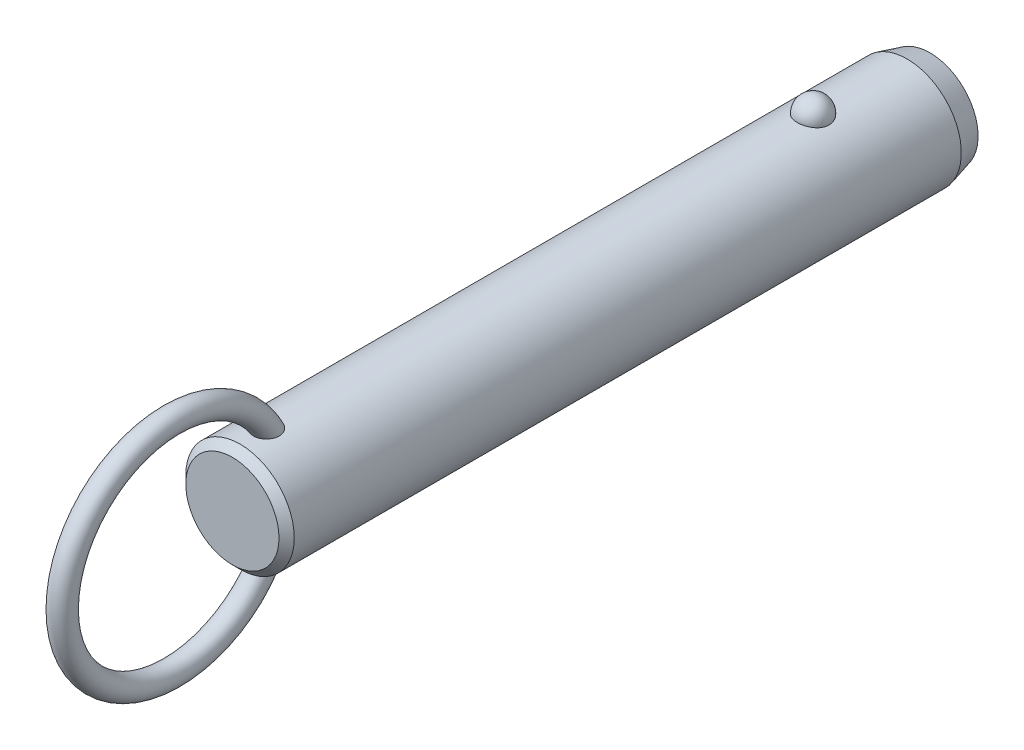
ISO-10303-21;
HEADER;
FILE_DESCRIPTION(('STEP AP214'),'2;1');
FILE_NAME('part.step','',(''),(''),'','','');
FILE_SCHEMA(('AUTOMOTIVE_DESIGN { 1 0 10303 214 1 1 1 1 }'));
ENDSEC;
DATA;
#1=APPLICATION_CONTEXT('core data for automotive mechanical design processes');
#2=APPLICATION_PROTOCOL_DEFINITION('international standard','automotive_design',2000,#1);
#3=PRODUCT_CONTEXT('',#1,'mechanical');
#4=PRODUCT('Part','Part','',(#3));
#5=PRODUCT_RELATED_PRODUCT_CATEGORY('part','',(#4));
#6=PRODUCT_DEFINITION_FORMATION('','',#4);
#7=PRODUCT_DEFINITION_CONTEXT('part definition',#1,'design');
#8=PRODUCT_DEFINITION('design','',#6,#7);
#9=PRODUCT_DEFINITION_SHAPE('','',#8);
#10=(LENGTH_UNIT() NAMED_UNIT(*) SI_UNIT(.MILLI.,.METRE.));
#11=(NAMED_UNIT(*) PLANE_ANGLE_UNIT() SI_UNIT($,.RADIAN.));
#12=(NAMED_UNIT(*) SI_UNIT($,.STERADIAN.) SOLID_ANGLE_UNIT());
#13=UNCERTAINTY_MEASURE_WITH_UNIT(LENGTH_MEASURE(1.E-05),#10,'distance_accuracy_value','');
#14=(GEOMETRIC_REPRESENTATION_CONTEXT(3) GLOBAL_UNCERTAINTY_ASSIGNED_CONTEXT((#13)) GLOBAL_UNIT_ASSIGNED_CONTEXT((#10,
#11,#12)) REPRESENTATION_CONTEXT('',''));
#15=CARTESIAN_POINT('',(0.,0.,0.));
#16=DIRECTION('',(0.,0.,1.));
#17=DIRECTION('',(1.,0.,0.));
#18=AXIS2_PLACEMENT_3D('',#15,#16,#17);
#19=CARTESIAN_POINT('',(0.,0.,66.));
#20=DIRECTION('',(0.,0.,-1.));
#21=DIRECTION('',(-1.,0.,0.));
#22=AXIS2_PLACEMENT_3D('',#19,#20,#21);
#23=CYLINDRICAL_SURFACE('',#22,7.1);
#24=CARTESIAN_POINT('',(2.0769088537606,6.78943661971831,-2.1));
#25=CARTESIAN_POINT('',(2.07690739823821,6.78943796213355,-1.98268154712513));
#26=CARTESIAN_POINT('',(2.06738130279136,6.79237331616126,-1.86534506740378));
#27=CARTESIAN_POINT('',(2.0295040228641,6.8037853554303,-1.63400788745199));
#28=CARTESIAN_POINT('',(2.00114757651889,6.81226358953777,-1.52000812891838));
#29=CARTESIAN_POINT('',(1.92632025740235,6.83379798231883,-1.29863433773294));
#30=CARTESIAN_POINT('',(1.87985726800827,6.84685214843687,-1.19125744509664));
#31=CARTESIAN_POINT('',(1.76995205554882,6.87608091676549,-0.98604657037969));
#32=CARTESIAN_POINT('',(1.70650980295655,6.8922555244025,-0.88821260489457));
#33=CARTESIAN_POINT('',(1.5638119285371,6.92602930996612,-0.704242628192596));
#34=CARTESIAN_POINT('',(1.4844714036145,6.94363582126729,-0.618173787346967));
#35=CARTESIAN_POINT('',(1.31221746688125,6.97823658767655,-0.460740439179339));
#36=CARTESIAN_POINT('',(1.21930409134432,6.99523084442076,-0.389375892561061));
#37=CARTESIAN_POINT('',(1.02268781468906,7.02666176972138,-0.263547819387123));
#38=CARTESIAN_POINT('',(0.91902009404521,7.04110638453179,-0.209031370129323));
#39=CARTESIAN_POINT('',(0.703548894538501,7.06588726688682,-0.118163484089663));
#40=CARTESIAN_POINT('',(0.591746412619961,7.07622403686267,-0.0818098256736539));
#41=CARTESIAN_POINT('',(0.365557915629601,7.09147068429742,-0.0288711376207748));
#42=CARTESIAN_POINT('',(0.251267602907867,7.09648447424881,-0.0119070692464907));
#43=CARTESIAN_POINT('',(0.0213499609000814,7.10089837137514,0.00304925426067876));
#44=CARTESIAN_POINT('',(-0.0942772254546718,7.10029907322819,0.00104351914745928));
#45=CARTESIAN_POINT('',(-0.321651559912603,7.09360829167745,-0.0216931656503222));
#46=CARTESIAN_POINT('',(-0.433431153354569,7.08760388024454,-0.0421272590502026));
#47=CARTESIAN_POINT('',(-0.651862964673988,7.07086131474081,-0.100729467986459));
#48=CARTESIAN_POINT('',(-0.758515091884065,7.06012307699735,-0.138897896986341));
#49=CARTESIAN_POINT('',(-0.964449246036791,7.03496097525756,-0.232213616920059));
#50=CARTESIAN_POINT('',(-1.06368095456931,7.02051445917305,-0.287465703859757));
#51=CARTESIAN_POINT('',(-1.25145353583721,6.98948740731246,-0.413383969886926));
#52=CARTESIAN_POINT('',(-1.33999321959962,6.97290663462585,-0.48405186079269));
#53=CARTESIAN_POINT('',(-1.50591604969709,6.93898770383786,-0.640594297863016));
#54=CARTESIAN_POINT('',(-1.58302488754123,6.92164094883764,-0.726757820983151));
#55=CARTESIAN_POINT('',(-1.72189320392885,6.8884103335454,-0.91092752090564));
#56=CARTESIAN_POINT('',(-1.78365144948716,6.87252659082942,-1.008934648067));
#57=CARTESIAN_POINT('',(-1.89101272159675,6.84377189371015,-1.21549497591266));
#58=CARTESIAN_POINT('',(-1.93639553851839,6.83094274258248,-1.32416860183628));
#59=CARTESIAN_POINT('',(-2.00874275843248,6.81002070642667,-1.54791500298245));
#60=CARTESIAN_POINT('',(-2.03570774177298,6.80192767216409,-1.66298757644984));
#61=CARTESIAN_POINT('',(-2.07047276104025,6.7914266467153,-1.89571453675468));
#62=CARTESIAN_POINT('',(-2.07835878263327,6.78899315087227,-2.01335491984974));
#63=CARTESIAN_POINT('',(-2.07502083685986,6.79001409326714,-2.24833570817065));
#64=CARTESIAN_POINT('',(-2.06379746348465,6.7934683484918,-2.36567612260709));
#65=CARTESIAN_POINT('',(-2.02263913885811,6.80583442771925,-2.59603194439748));
#66=CARTESIAN_POINT('',(-1.99281127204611,6.81471501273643,-2.70906820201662));
#67=CARTESIAN_POINT('',(-1.91526639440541,6.83691232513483,-2.92836575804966));
#68=CARTESIAN_POINT('',(-1.8675486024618,6.85022924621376,-3.03462676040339));
#69=CARTESIAN_POINT('',(-1.75504492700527,6.87991336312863,-3.23806487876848));
#70=CARTESIAN_POINT('',(-1.69015924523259,6.89629822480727,-3.33518422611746));
#71=CARTESIAN_POINT('',(-1.54505404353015,6.93024852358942,-3.51697105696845));
#72=CARTESIAN_POINT('',(-1.46483385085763,6.94781401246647,-3.60163799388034));
#73=CARTESIAN_POINT('',(-1.29071406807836,6.98225977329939,-3.75654119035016));
#74=CARTESIAN_POINT('',(-1.19675650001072,6.99913673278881,-3.82671308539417));
#75=CARTESIAN_POINT('',(-0.997940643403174,7.03023618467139,-3.9501837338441));
#76=CARTESIAN_POINT('',(-0.89308318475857,7.04445887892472,-4.00348377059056));
#77=CARTESIAN_POINT('',(-0.676902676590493,7.06848365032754,-4.09107242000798));
#78=CARTESIAN_POINT('',(-0.565686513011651,7.0783430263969,-4.12560889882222));
#79=CARTESIAN_POINT('',(-0.338739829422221,7.09282534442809,-4.17575450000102));
#80=CARTESIAN_POINT('',(-0.223009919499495,7.09744899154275,-4.19136617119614));
#81=CARTESIAN_POINT('',(0.00707628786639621,7.10090930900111,-4.20307965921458));
#82=CARTESIAN_POINT('',(0.121410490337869,7.09986531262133,-4.19958377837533));
#83=CARTESIAN_POINT('',(0.347815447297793,7.092380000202,-4.17411564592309));
#84=CARTESIAN_POINT('',(0.459886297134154,7.08593891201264,-4.15214417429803));
#85=CARTESIAN_POINT('',(0.678084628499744,7.06838983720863,-4.09049562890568));
#86=CARTESIAN_POINT('',(0.784237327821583,7.05730369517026,-4.05090137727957));
#87=CARTESIAN_POINT('',(0.988305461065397,7.03163139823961,-3.95511447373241));
#88=CARTESIAN_POINT('',(1.08622031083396,7.01704499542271,-3.89892064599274));
#89=CARTESIAN_POINT('',(1.27284490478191,6.98562668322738,-3.77035541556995));
#90=CARTESIAN_POINT('',(1.36137372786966,6.96876135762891,-3.69772964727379));
#91=CARTESIAN_POINT('',(1.52509486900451,6.93477412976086,-3.53878279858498));
#92=CARTESIAN_POINT('',(1.60028496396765,6.91765218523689,-3.45245943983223));
#93=CARTESIAN_POINT('',(1.73681688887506,6.88465753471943,-3.26658774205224));
#94=CARTESIAN_POINT('',(1.79785966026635,6.86881574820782,-3.16681408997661));
#95=CARTESIAN_POINT('',(1.90265327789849,6.84053157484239,-2.95814408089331));
#96=CARTESIAN_POINT('',(1.94640861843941,6.82808830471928,-2.84925010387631));
#97=CARTESIAN_POINT('',(2.01274378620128,6.80881460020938,-2.63454318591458));
#98=CARTESIAN_POINT('',(2.03676193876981,6.80160856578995,-2.52920574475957));
#99=CARTESIAN_POINT('',(2.06884490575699,6.79191902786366,-2.3159172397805));
#100=CARTESIAN_POINT('',(2.07691019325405,6.78943538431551,-2.20796625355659));
#101=CARTESIAN_POINT('',(2.0769088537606,6.78943661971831,-2.1));
#102=B_SPLINE_CURVE_WITH_KNOTS('',3,(#24,#25,#26,#27,#28,#29,#30,#31,#32,#33,#34,#35,#36,#37,
#38,#39,#40,#41,#42,#43,#44,#45,#46,#47,#48,#49,#50,#51,#52,#53,#54,#55,#56,#57,#58,#59,#60,#61,
#62,#63,#64,#65,#66,#67,#68,#69,#70,#71,#72,#73,#74,#75,#76,#77,#78,#79,#80,#81,#82,#83,#84,#85,
#86,#87,#88,#89,#90,#91,#92,#93,#94,#95,#96,#97,#98,#99,#100,#101),.UNSPECIFIED.,.T.,.F.,(4,2,2,
2,2,2,2,2,2,2,2,2,2,2,2,2,2,2,2,2,2,2,2,2,2,2,2,2,2,2,2,2,2,2,2,2,2,2,4),(0.,0.351568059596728,
0.703234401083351,1.05474780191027,1.40626181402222,1.75970563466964,2.11314851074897,
2.4654696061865,2.81774759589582,3.16301449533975,3.50824481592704,3.84801136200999,
4.18778391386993,4.52968352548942,4.87162112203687,5.22076181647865,5.56993054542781,
5.92363364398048,6.27732559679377,6.62942052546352,6.98150450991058,7.33158042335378,
7.68167162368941,8.03384443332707,8.38603269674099,8.73975272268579,9.09344583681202,
9.44234545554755,9.79119807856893,10.1327344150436,10.4742563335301,10.8141898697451,
11.1541474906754,11.4997793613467,11.8454687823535,12.1979079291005,12.5502553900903,
12.8738073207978,13.1973496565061),.UNSPECIFIED.);
#103=CARTESIAN_POINT('',(2.0769088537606,6.78943661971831,-2.1));
#104=VERTEX_POINT('',#103);
#105=EDGE_CURVE('E41',#104,#104,#102,.T.);
#106=ORIENTED_EDGE('',*,*,#105,.T.);
#107=EDGE_LOOP('',(#106));
#108=FACE_BOUND('',#107,.T.);
#109=CARTESIAN_POINT('',(0.,0.,72.92));
#110=DIRECTION('',(0.,0.,1.));
#111=DIRECTION('',(1.,0.,0.));
#112=AXIS2_PLACEMENT_3D('',#109,#110,#111);
#113=CIRCLE('',#112,7.1);
#114=CARTESIAN_POINT('',(7.1,0.,72.92));
#115=VERTEX_POINT('',#114);
#116=EDGE_CURVE('E10',#115,#115,#113,.F.);
#117=ORIENTED_EDGE('',*,*,#116,.T.);
#118=EDGE_LOOP('',(#117));
#119=FACE_BOUND('',#118,.T.);
#120=CARTESIAN_POINT('',(-0.429539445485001,-7.08699541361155,67.7429212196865));
#121=CARTESIAN_POINT('',(-0.508331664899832,-7.08221999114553,67.7668764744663));
#122=CARTESIAN_POINT('',(-0.58503984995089,-7.07624016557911,67.7974570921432));
#123=CARTESIAN_POINT('',(-0.732082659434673,-7.06254296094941,67.8710242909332));
#124=CARTESIAN_POINT('',(-0.802417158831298,-7.05482554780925,67.9140111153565));
#125=CARTESIAN_POINT('',(-0.93472277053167,-7.03851844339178,68.0111135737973));
#126=CARTESIAN_POINT('',(-0.99670020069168,-7.02992941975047,68.0652207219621));
#127=CARTESIAN_POINT('',(-1.11079942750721,-7.01280697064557,68.1829676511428));
#128=CARTESIAN_POINT('',(-1.16292136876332,-7.00427354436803,68.2466072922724));
#129=CARTESIAN_POINT('',(-1.25705660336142,-6.98799959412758,68.3826870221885));
#130=CARTESIAN_POINT('',(-1.29888032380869,-6.98027525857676,68.4552598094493));
#131=CARTESIAN_POINT('',(-1.37069920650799,-6.96652886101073,68.6061686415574));
#132=CARTESIAN_POINT('',(-1.40069157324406,-6.96050720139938,68.6845060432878));
#133=CARTESIAN_POINT('',(-1.45043507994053,-6.95031881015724,68.8501903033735));
#134=CARTESIAN_POINT('',(-1.46937115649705,-6.94630231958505,68.9377897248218));
#135=CARTESIAN_POINT('',(-1.49424917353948,-6.94099239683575,69.1148714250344));
#136=CARTESIAN_POINT('',(-1.50018601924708,-6.93970003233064,69.2043544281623));
#137=CARTESIAN_POINT('',(-1.49978214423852,-6.93978815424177,69.3940607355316));
#138=CARTESIAN_POINT('',(-1.49187639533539,-6.94150934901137,69.494279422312));
#139=CARTESIAN_POINT('',(-1.46177925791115,-6.94790814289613,69.6924798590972));
#140=CARTESIAN_POINT('',(-1.43957541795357,-6.95258831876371,69.790459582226));
#141=CARTESIAN_POINT('',(-1.37783293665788,-6.96510647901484,69.9953629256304));
#142=CARTESIAN_POINT('',(-1.33634073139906,-6.97328848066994,70.1016801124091));
#143=CARTESIAN_POINT('',(-1.23686994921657,-6.99161706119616,70.3061777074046));
#144=CARTESIAN_POINT('',(-1.17889192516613,-7.00176357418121,70.4043583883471));
#145=CARTESIAN_POINT('',(-1.0587512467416,-7.02082898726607,70.5723743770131));
#146=CARTESIAN_POINT('',(-0.999247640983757,-7.02963746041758,70.6441230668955));
#147=CARTESIAN_POINT('',(-0.869494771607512,-7.04686074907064,70.7771959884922));
#148=CARTESIAN_POINT('',(-0.799263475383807,-7.05527619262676,70.8385372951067));
#149=CARTESIAN_POINT('',(-0.665408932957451,-7.06899457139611,70.9351316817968));
#150=CARTESIAN_POINT('',(-0.603817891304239,-7.07457275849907,70.9731512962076));
#151=CARTESIAN_POINT('',(-0.475172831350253,-7.08437420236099,71.0387581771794));
#152=CARTESIAN_POINT('',(-0.408123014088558,-7.08859848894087,71.0663533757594));
#153=CARTESIAN_POINT('',(-0.269431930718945,-7.09522749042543,71.1092569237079));
#154=CARTESIAN_POINT('',(-0.197757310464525,-7.09761688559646,71.1244618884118));
#155=CARTESIAN_POINT('',(-0.0527849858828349,-7.10017268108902,71.1407168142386));
#156=CARTESIAN_POINT('',(0.0205115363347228,-7.10034065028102,71.1417767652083));
#157=CARTESIAN_POINT('',(0.15642613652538,-7.09855986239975,71.1304619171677));
#158=CARTESIAN_POINT('',(0.219199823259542,-7.09688191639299,71.1198060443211));
#159=CARTESIAN_POINT('',(0.342134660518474,-7.09201880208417,71.0885379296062));
#160=CARTESIAN_POINT('',(0.402295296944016,-7.08883333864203,71.0679237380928));
#161=CARTESIAN_POINT('',(0.520687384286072,-7.08113868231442,71.0172125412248));
#162=CARTESIAN_POINT('',(0.578791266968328,-7.07658958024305,70.9868272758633));
#163=CARTESIAN_POINT('',(0.690173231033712,-7.06659708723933,70.9183678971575));
#164=CARTESIAN_POINT('',(0.74344785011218,-7.061153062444,70.8802883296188));
#165=CARTESIAN_POINT('',(0.870947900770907,-7.04680292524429,70.7765929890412));
#166=CARTESIAN_POINT('',(0.941828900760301,-7.0375580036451,70.7068972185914));
#167=CARTESIAN_POINT('',(1.07136606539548,-7.01900793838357,70.5569450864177));
#168=CARTESIAN_POINT('',(1.13000013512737,-7.00970271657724,70.4766700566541));
#169=CARTESIAN_POINT('',(1.23579584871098,-6.99183327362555,70.3068997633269));
#170=CARTESIAN_POINT('',(1.2827427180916,-6.98328455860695,70.2172696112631));
#171=CARTESIAN_POINT('',(1.36351442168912,-6.96796352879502,70.0321763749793));
#172=CARTESIAN_POINT('',(1.39733971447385,-6.96119115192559,69.9367134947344));
#173=CARTESIAN_POINT('',(1.45579181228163,-6.94922464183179,69.7253092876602));
#174=CARTESIAN_POINT('',(1.47790145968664,-6.94449000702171,69.608631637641));
#175=CARTESIAN_POINT('',(1.50168752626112,-6.93938731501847,69.3730153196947));
#176=CARTESIAN_POINT('',(1.50336085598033,-6.93901991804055,69.2540763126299));
#177=CARTESIAN_POINT('',(1.48486516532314,-6.9430010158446,69.0236079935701));
#178=CARTESIAN_POINT('',(1.46573441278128,-6.9471253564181,68.911995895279));
#179=CARTESIAN_POINT('',(1.40606892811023,-6.95944667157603,68.6948868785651));
#180=CARTESIAN_POINT('',(1.36556446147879,-6.96763788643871,68.5893815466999));
#181=CARTESIAN_POINT('',(1.27082700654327,-6.98548038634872,68.4042879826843));
#182=CARTESIAN_POINT('',(1.21949810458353,-6.99473841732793,68.3231719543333));
#183=CARTESIAN_POINT('',(1.10242050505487,-7.01414069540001,68.1722278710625));
#184=CARTESIAN_POINT('',(1.03668119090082,-7.02428436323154,68.1023925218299));
#185=CARTESIAN_POINT('',(0.900559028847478,-7.04295285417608,67.9835735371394));
#186=CARTESIAN_POINT('',(0.83142884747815,-7.05153466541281,67.9331573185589));
#187=CARTESIAN_POINT('',(0.685291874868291,-7.06723150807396,67.8451429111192));
#188=CARTESIAN_POINT('',(0.60828720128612,-7.0743469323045,67.8075412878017));
#189=CARTESIAN_POINT('',(0.451878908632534,-7.08602232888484,67.7474915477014));
#190=CARTESIAN_POINT('',(0.37268652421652,-7.09067127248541,67.7245088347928));
#191=CARTESIAN_POINT('',(0.211477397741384,-7.09730788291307,67.6920357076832));
#192=CARTESIAN_POINT('',(0.129460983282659,-7.09929585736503,67.6825437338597));
#193=CARTESIAN_POINT('',(-0.0332905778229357,-7.10037858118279,67.6773517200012));
#194=CARTESIAN_POINT('',(-0.114016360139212,-7.09953334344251,67.6813656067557));
#195=CARTESIAN_POINT('',(-0.273670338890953,-7.09517338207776,67.7024540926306));
#196=CARTESIAN_POINT('',(-0.352598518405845,-7.09165863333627,67.7195288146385));
#197=CARTESIAN_POINT('',(-0.429539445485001,-7.08699541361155,67.7429212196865));
#198=B_SPLINE_CURVE_WITH_KNOTS('',3,(#120,#121,#122,#123,#124,#125,#126,#127,#128,#129,#130,
#131,#132,#133,#134,#135,#136,#137,#138,#139,#140,#141,#142,#143,#144,#145,#146,#147,#148,#149,
#150,#151,#152,#153,#154,#155,#156,#157,#158,#159,#160,#161,#162,#163,#164,#165,#166,#167,#168,
#169,#170,#171,#172,#173,#174,#175,#176,#177,#178,#179,#180,#181,#182,#183,#184,#185,#186,#187,
#188,#189,#190,#191,#192,#193,#194,#195,#196,#197),.UNSPECIFIED.,.T.,.F.,(4,2,2,2,2,2,2,2,2,2,2,
2,2,2,2,2,2,2,2,2,2,2,2,2,2,2,2,2,2,2,2,2,2,2,2,2,2,2,4),(0.,0.247183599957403,
0.494372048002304,0.741372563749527,0.988369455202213,1.23962059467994,1.49093106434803,
1.75897818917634,2.02713035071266,2.32758265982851,2.62829697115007,2.97008736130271,
3.31186629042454,3.59175319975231,3.87117637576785,4.08813841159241,4.30493502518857,
4.52352259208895,4.74195577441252,4.9321532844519,5.12238804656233,5.31884850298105,
5.51544871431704,5.81332317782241,6.11173048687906,6.41527266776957,6.71880423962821,
7.07358156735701,7.42841252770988,7.76631485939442,8.10373999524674,8.3914224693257,
8.67891817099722,8.93560332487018,9.19221962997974,9.43881106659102,9.68537399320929,
9.92674752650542,10.1681233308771),.UNSPECIFIED.);
#199=CARTESIAN_POINT('',(-0.429539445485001,-7.08699541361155,67.7429212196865));
#200=VERTEX_POINT('',#199);
#201=EDGE_CURVE('E60',#200,#200,#198,.T.);
#202=ORIENTED_EDGE('',*,*,#201,.T.);
#203=EDGE_LOOP('',(#202));
#204=FACE_BOUND('',#203,.T.);
#205=CARTESIAN_POINT('',(-0.429539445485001,7.08699541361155,67.7429212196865));
#206=CARTESIAN_POINT('',(-0.351665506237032,7.09171429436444,67.7192469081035));
#207=CARTESIAN_POINT('',(-0.271733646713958,7.09525896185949,67.7020369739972));
#208=CARTESIAN_POINT('',(-0.110026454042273,7.09960839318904,67.6810059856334));
#209=CARTESIAN_POINT('',(-0.028250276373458,7.10041187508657,67.677191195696));
#210=CARTESIAN_POINT('',(0.134782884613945,7.09918849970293,67.683059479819));
#211=CARTESIAN_POINT('',(0.216039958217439,7.09716214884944,67.6927401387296));
#212=CARTESIAN_POINT('',(0.375730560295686,7.09050177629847,67.7253471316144));
#213=CARTESIAN_POINT('',(0.454164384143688,7.08586802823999,67.7482720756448));
#214=CARTESIAN_POINT('',(0.60602533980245,7.07449911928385,67.806771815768));
#215=CARTESIAN_POINT('',(0.67945100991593,7.06776334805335,67.8423502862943));
#216=CARTESIAN_POINT('',(0.819234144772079,7.05292866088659,67.9251753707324));
#217=CARTESIAN_POINT('',(0.885591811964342,7.04482978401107,67.9724216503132));
#218=CARTESIAN_POINT('',(1.00993211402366,7.02808709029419,68.0775902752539));
#219=CARTESIAN_POINT('',(1.06785399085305,7.01943990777,68.135583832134));
#220=CARTESIAN_POINT('',(1.17342527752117,7.00256662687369,68.2603013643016));
#221=CARTESIAN_POINT('',(1.22107408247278,6.99434055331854,68.3270258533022));
#222=CARTESIAN_POINT('',(1.30652927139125,6.97889183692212,68.4693622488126));
#223=CARTESIAN_POINT('',(1.34399711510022,6.97170674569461,68.5451808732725));
#224=CARTESIAN_POINT('',(1.40682616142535,6.95930080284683,68.7018100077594));
#225=CARTESIAN_POINT('',(1.43218374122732,6.9540805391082,68.7826220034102));
#226=CARTESIAN_POINT('',(1.47246409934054,6.94566853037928,68.9535314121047));
#227=CARTESIAN_POINT('',(1.48642590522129,6.9426653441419,69.0438630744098));
#228=CARTESIAN_POINT('',(1.5011410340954,6.93949744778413,69.225619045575));
#229=CARTESIAN_POINT('',(1.50188917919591,6.93933385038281,69.3170437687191));
#230=CARTESIAN_POINT('',(1.49030464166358,6.94183245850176,69.5108438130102));
#231=CARTESIAN_POINT('',(1.47627413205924,6.94486147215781,69.613112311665));
#232=CARTESIAN_POINT('',(1.43356351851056,6.95380194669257,69.8144719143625));
#233=CARTESIAN_POINT('',(1.4048676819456,6.95971650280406,69.9135594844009));
#234=CARTESIAN_POINT('',(1.32908750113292,6.97461208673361,70.1189087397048));
#235=CARTESIAN_POINT('',(1.28011435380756,6.98388945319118,70.2244566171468));
#236=CARTESIAN_POINT('',(1.16520357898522,7.00397743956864,70.4257604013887));
#237=CARTESIAN_POINT('',(1.09927694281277,7.01478706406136,70.5215225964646));
#238=CARTESIAN_POINT('',(0.969361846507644,7.03373936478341,70.6767565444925));
#239=CARTESIAN_POINT('',(0.909042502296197,7.04187023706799,70.7393032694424));
#240=CARTESIAN_POINT('',(0.779178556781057,7.05741732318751,70.8540535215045));
#241=CARTESIAN_POINT('',(0.709649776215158,7.06483472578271,70.9062744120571));
#242=CARTESIAN_POINT('',(0.576854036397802,7.0767751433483,70.9881138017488));
#243=CARTESIAN_POINT('',(0.515118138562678,7.08158033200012,71.0201641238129));
#244=CARTESIAN_POINT('',(0.387127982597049,7.08972701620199,71.0737656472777));
#245=CARTESIAN_POINT('',(0.320877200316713,7.09306962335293,71.0953248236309));
#246=CARTESIAN_POINT('',(0.185041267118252,7.09791507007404,71.1264005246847));
#247=CARTESIAN_POINT('',(0.115437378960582,7.09940591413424,71.1358385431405));
#248=CARTESIAN_POINT('',(-0.0243157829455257,7.10030171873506,71.1415226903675));
#249=CARTESIAN_POINT('',(-0.0944648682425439,7.0997073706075,71.1377731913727));
#250=CARTESIAN_POINT('',(-0.225713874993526,7.09668414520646,71.1185081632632));
#251=CARTESIAN_POINT('',(-0.287006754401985,7.09444865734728,71.1042323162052));
#252=CARTESIAN_POINT('',(-0.406555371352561,7.08860360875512,71.0663685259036));
#253=CARTESIAN_POINT('',(-0.46480981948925,7.08499346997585,71.0427766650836));
#254=CARTESIAN_POINT('',(-0.594955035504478,7.07541654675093,70.9789232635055));
#255=CARTESIAN_POINT('',(-0.665389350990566,7.06906574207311,70.935753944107));
#256=CARTESIAN_POINT('',(-0.798242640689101,7.05530261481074,70.838587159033));
#257=CARTESIAN_POINT('',(-0.860645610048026,7.0478882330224,70.7845686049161));
#258=CARTESIAN_POINT('',(-0.994249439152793,7.03045217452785,70.6509965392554));
#259=CARTESIAN_POINT('',(-1.06260129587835,7.02030745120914,70.5686143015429));
#260=CARTESIAN_POINT('',(-1.18502045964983,7.00068382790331,70.393843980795));
#261=CARTESIAN_POINT('',(-1.23907684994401,6.99120544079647,70.301448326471));
#262=CARTESIAN_POINT('',(-1.33335589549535,6.97384343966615,70.1080085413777));
#263=CARTESIAN_POINT('',(-1.3733613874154,6.96598557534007,70.0068564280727));
#264=CARTESIAN_POINT('',(-1.43770677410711,6.9529905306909,69.7995046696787));
#265=CARTESIAN_POINT('',(-1.46204473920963,6.94785368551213,69.69330440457));
#266=CARTESIAN_POINT('',(-1.49537533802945,6.94076296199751,69.4682317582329));
#267=CARTESIAN_POINT('',(-1.50273564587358,6.93914842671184,69.3490975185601));
#268=CARTESIAN_POINT('',(-1.4954555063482,6.94072368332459,69.1114703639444));
#269=CARTESIAN_POINT('',(-1.48082914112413,6.94391040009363,68.9929770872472));
#270=CARTESIAN_POINT('',(-1.43076401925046,6.95438579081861,68.7734325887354));
#271=CARTESIAN_POINT('',(-1.39762227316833,6.96121852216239,68.6718413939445));
#272=CARTESIAN_POINT('',(-1.31211274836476,6.97783941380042,68.4773513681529));
#273=CARTESIAN_POINT('',(-1.2597660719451,6.98762432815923,68.3844431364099));
#274=CARTESIAN_POINT('',(-1.14583073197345,7.00713153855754,68.2241601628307));
#275=CARTESIAN_POINT('',(-1.08665947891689,7.01665982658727,68.1550351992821));
#276=CARTESIAN_POINT('',(-0.956606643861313,7.03556646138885,68.0288786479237));
#277=CARTESIAN_POINT('',(-0.885737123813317,7.04494495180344,67.9718347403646));
#278=CARTESIAN_POINT('',(-0.751558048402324,7.06035735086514,67.8831004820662));
#279=CARTESIAN_POINT('',(-0.690120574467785,7.0666695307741,67.8485932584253));
#280=CARTESIAN_POINT('',(-0.562815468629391,7.07794609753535,67.7887507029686));
#281=CARTESIAN_POINT('',(-0.496948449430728,7.08291067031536,67.7634141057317));
#282=CARTESIAN_POINT('',(-0.429539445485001,7.08699541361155,67.7429212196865));
#283=B_SPLINE_CURVE_WITH_KNOTS('',3,(#205,#206,#207,#208,#209,#210,#211,#212,#213,#214,#215,
#216,#217,#218,#219,#220,#221,#222,#223,#224,#225,#226,#227,#228,#229,#230,#231,#232,#233,#234,
#235,#236,#237,#238,#239,#240,#241,#242,#243,#244,#245,#246,#247,#248,#249,#250,#251,#252,#253,
#254,#255,#256,#257,#258,#259,#260,#261,#262,#263,#264,#265,#266,#267,#268,#269,#270,#271,#272,
#273,#274,#275,#276,#277,#278,#279,#280,#281,#282),.UNSPECIFIED.,.T.,.F.,(4,2,2,2,2,2,2,2,2,2,2,
2,2,2,2,2,2,2,2,2,2,2,2,2,2,2,2,2,2,2,2,2,2,2,2,2,2,2,4),(0.,0.244335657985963,
0.488785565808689,0.733191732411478,0.977572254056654,1.22202379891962,1.46646834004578,
1.71259457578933,1.9587352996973,2.21226768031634,2.46587585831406,2.7391381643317,
3.01250754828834,3.32109936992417,3.63002293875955,3.97863512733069,4.32702187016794,
4.58793945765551,4.84841449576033,5.05676704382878,5.26496096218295,5.47449661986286,
5.68396281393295,5.87205447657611,6.06022532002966,6.30743751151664,6.55513496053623,
6.87602468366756,7.19715875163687,7.52305774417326,7.84899686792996,8.20516155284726,
8.56109821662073,8.8804008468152,9.19935367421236,9.4723628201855,9.74509220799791,
9.95662250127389,10.1681235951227),.UNSPECIFIED.);
#284=CARTESIAN_POINT('',(-0.429539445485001,7.08699541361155,67.7429212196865));
#285=VERTEX_POINT('',#284);
#286=EDGE_CURVE('E68',#285,#285,#283,.T.);
#287=ORIENTED_EDGE('',*,*,#286,.T.);
#288=EDGE_LOOP('',(#287));
#289=FACE_BOUND('',#288,.T.);
#290=CARTESIAN_POINT('',(0.,0.,-14.3999999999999));
#291=DIRECTION('',(0.,0.,-1.));
#292=DIRECTION('',(-1.,0.,0.));
#293=AXIS2_PLACEMENT_3D('',#290,#291,#292);
#294=CIRCLE('',#293,7.1);
#295=CARTESIAN_POINT('',(-7.1,0.,-14.3999999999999));
#296=VERTEX_POINT('',#295);
#297=EDGE_CURVE('E57',#296,#296,#294,.F.);
#298=ORIENTED_EDGE('',*,*,#297,.T.);
#299=EDGE_LOOP('',(#298));
#300=FACE_BOUND('',#299,.T.);
#301=ADVANCED_FACE('F37',(#108,#119,#204,#289,#300),#23,.T.);
#302=CARTESIAN_POINT('',(0.,0.,-17.4));
#303=DIRECTION('',(0.,0.,-1.));
#304=DIRECTION('',(-1.,0.,0.));
#305=AXIS2_PLACEMENT_3D('',#302,#303,#304);
#306=PLANE('',#305);
#307=CARTESIAN_POINT('',(0.,0.,-17.4));
#308=DIRECTION('',(0.,0.,-1.));
#309=DIRECTION('',(-1.,0.,0.));
#310=AXIS2_PLACEMENT_3D('',#307,#308,#309);
#311=CIRCLE('',#310,6.29615242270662);
#312=CARTESIAN_POINT('',(-6.29615242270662,0.,-17.4));
#313=VERTEX_POINT('',#312);
#314=EDGE_CURVE('E67',#313,#313,#311,.T.);
#315=ORIENTED_EDGE('',*,*,#314,.T.);
#316=EDGE_LOOP('',(#315));
#317=FACE_BOUND('',#316,.T.);
#318=ADVANCED_FACE('F86',(#317),#306,.T.);
#319=CARTESIAN_POINT('',(0.,0.,-17.4));
#320=DIRECTION('',(0.,0.,1.));
#321=DIRECTION('',(1.,0.,0.));
#322=AXIS2_PLACEMENT_3D('',#319,#320,#321);
#323=CONICAL_SURFACE('',#322,6.29615242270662,0.261799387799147);
#324=ORIENTED_EDGE('',*,*,#297,.F.);
#325=EDGE_LOOP('',(#324));
#326=FACE_BOUND('',#325,.T.);
#327=ORIENTED_EDGE('',*,*,#314,.F.);
#328=EDGE_LOOP('',(#327));
#329=FACE_BOUND('',#328,.T.);
#330=ADVANCED_FACE('F84',(#326,#329),#323,.T.);
#331=CARTESIAN_POINT('',(0.,0.,73.92));
#332=DIRECTION('',(0.,0.,1.));
#333=DIRECTION('',(1.,0.,0.));
#334=AXIS2_PLACEMENT_3D('',#331,#332,#333);
#335=PLANE('',#334);
#336=CARTESIAN_POINT('',(0.,0.,73.92));
#337=DIRECTION('',(0.,0.,1.));
#338=DIRECTION('',(1.,0.,0.));
#339=AXIS2_PLACEMENT_3D('',#336,#337,#338);
#340=CIRCLE('',#339,6.09999999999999);
#341=CARTESIAN_POINT('',(6.09999999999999,0.,73.92));
#342=VERTEX_POINT('',#341);
#343=EDGE_CURVE('E50',#342,#342,#340,.T.);
#344=ORIENTED_EDGE('',*,*,#343,.T.);
#345=EDGE_LOOP('',(#344));
#346=FACE_BOUND('',#345,.T.);
#347=ADVANCED_FACE('F78',(#346),#335,.T.);
#348=CARTESIAN_POINT('',(0.,0.,81.85));
#349=DIRECTION('',(1.,0.,0.));
#350=DIRECTION('',(0.,0.,-1.));
#351=AXIS2_PLACEMENT_3D('',#348,#349,#350);
#352=TOROIDAL_SURFACE('',#351,14.35,1.5);
#353=ORIENTED_EDGE('',*,*,#286,.F.);
#354=EDGE_LOOP('',(#353));
#355=FACE_BOUND('',#354,.T.);
#356=ORIENTED_EDGE('',*,*,#201,.F.);
#357=EDGE_LOOP('',(#356));
#358=FACE_BOUND('',#357,.T.);
#359=ADVANCED_FACE('F74',(#355,#358),#352,.T.);
#360=CARTESIAN_POINT('',(0.,0.,73.92));
#361=DIRECTION('',(0.,0.,-1.));
#362=DIRECTION('',(-1.,0.,0.));
#363=AXIS2_PLACEMENT_3D('',#360,#361,#362);
#364=CONICAL_SURFACE('',#363,6.09999999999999,0.78539816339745);
#365=ORIENTED_EDGE('',*,*,#116,.F.);
#366=EDGE_LOOP('',(#365));
#367=FACE_BOUND('',#366,.T.);
#368=ORIENTED_EDGE('',*,*,#343,.F.);
#369=EDGE_LOOP('',(#368));
#370=FACE_BOUND('',#369,.T.);
#371=ADVANCED_FACE('F39',(#367,#370),#364,.T.);
#372=CARTESIAN_POINT('',(0.,7.1,-2.1));
#373=DIRECTION('',(0.,1.,0.));
#374=DIRECTION('',(0.,0.,1.));
#375=AXIS2_PLACEMENT_3D('',#372,#373,#374);
#376=SPHERICAL_SURFACE('',#375,2.10000000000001);
#377=ORIENTED_EDGE('',*,*,#105,.F.);
#378=EDGE_LOOP('',(#377));
#379=FACE_BOUND('',#378,.T.);
#380=ADVANCED_FACE('F80',(#379),#376,.T.);
#381=CLOSED_SHELL('',(#301,#318,#330,#347,#359,#371,#380));
#382=MANIFOLD_SOLID_BREP('B2',#381);
#383=ADVANCED_BREP_SHAPE_REPRESENTATION('',(#18,#382),#14);
#384=SHAPE_DEFINITION_REPRESENTATION(#9,#383);
ENDSEC;
END-ISO-10303-21;
